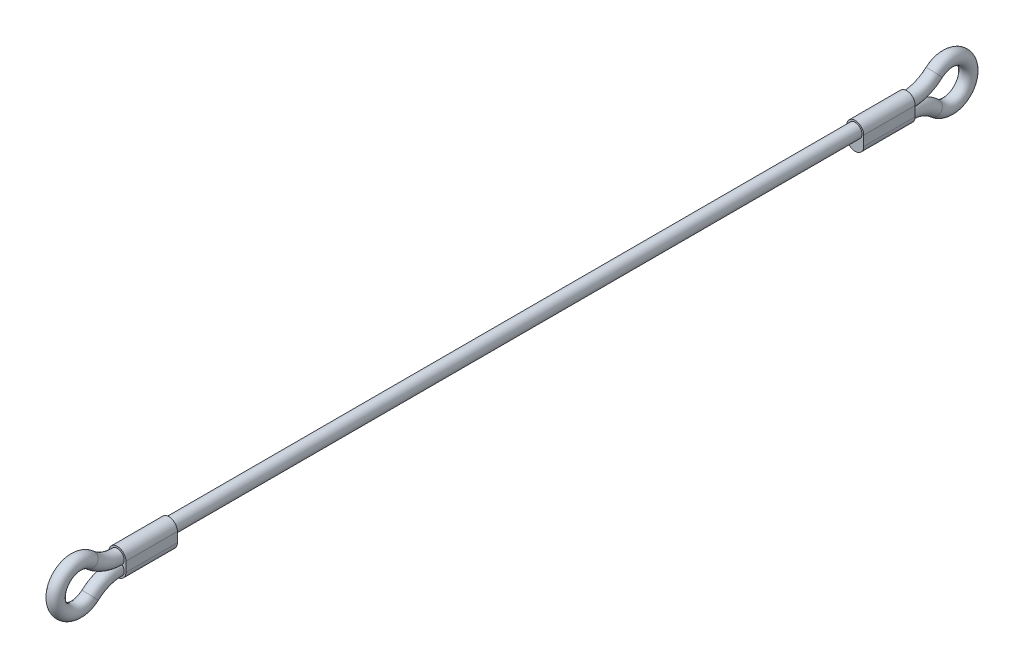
ISO-10303-21;
HEADER;
FILE_DESCRIPTION(('STEP AP214'),'2;1');
FILE_NAME('part.step','',(''),(''),'','','');
FILE_SCHEMA(('AUTOMOTIVE_DESIGN { 1 0 10303 214 1 1 1 1 }'));
ENDSEC;
DATA;
#1=APPLICATION_CONTEXT('core data for automotive mechanical design processes');
#2=APPLICATION_PROTOCOL_DEFINITION('international standard','automotive_design',2000,#1);
#3=PRODUCT_CONTEXT('',#1,'mechanical');
#4=PRODUCT('Part','Part','',(#3));
#5=PRODUCT_RELATED_PRODUCT_CATEGORY('part','',(#4));
#6=PRODUCT_DEFINITION_FORMATION('','',#4);
#7=PRODUCT_DEFINITION_CONTEXT('part definition',#1,'design');
#8=PRODUCT_DEFINITION('design','',#6,#7);
#9=PRODUCT_DEFINITION_SHAPE('','',#8);
#10=(LENGTH_UNIT() NAMED_UNIT(*) SI_UNIT(.MILLI.,.METRE.));
#11=(NAMED_UNIT(*) PLANE_ANGLE_UNIT() SI_UNIT($,.RADIAN.));
#12=(NAMED_UNIT(*) SI_UNIT($,.STERADIAN.) SOLID_ANGLE_UNIT());
#13=UNCERTAINTY_MEASURE_WITH_UNIT(LENGTH_MEASURE(1.E-05),#10,'distance_accuracy_value','');
#14=(GEOMETRIC_REPRESENTATION_CONTEXT(3) GLOBAL_UNCERTAINTY_ASSIGNED_CONTEXT((#13)) GLOBAL_UNIT_ASSIGNED_CONTEXT((#10,
#11,#12)) REPRESENTATION_CONTEXT('',''));
#15=CARTESIAN_POINT('',(0.,0.,0.));
#16=DIRECTION('',(0.,0.,1.));
#17=DIRECTION('',(1.,0.,0.));
#18=AXIS2_PLACEMENT_3D('',#15,#16,#17);
#19=CARTESIAN_POINT('',(0.,0.,-92.));
#20=DIRECTION('',(0.,0.,1.));
#21=DIRECTION('',(1.,0.,0.));
#22=AXIS2_PLACEMENT_3D('',#19,#20,#21);
#23=CYLINDRICAL_SURFACE('',#22,1.59);
#24=CARTESIAN_POINT('',(0.,0.,-80.));
#25=DIRECTION('',(0.,0.,1.));
#26=DIRECTION('',(0.,-1.,0.));
#27=AXIS2_PLACEMENT_3D('',#24,#25,#26);
#28=CIRCLE('',#27,1.59);
#29=CARTESIAN_POINT('',(0.,-1.59,-80.));
#30=VERTEX_POINT('',#29);
#31=EDGE_CURVE('E11',#30,#30,#28,.F.);
#32=ORIENTED_EDGE('',*,*,#31,.F.);
#33=EDGE_LOOP('',(#32));
#34=FACE_BOUND('',#33,.T.);
#35=CARTESIAN_POINT('',(0.,0.,80.));
#36=DIRECTION('',(0.,0.,-1.));
#37=DIRECTION('',(0.,1.,0.));
#38=AXIS2_PLACEMENT_3D('',#35,#36,#37);
#39=CIRCLE('',#38,1.59);
#40=CARTESIAN_POINT('',(0.,1.59,80.));
#41=VERTEX_POINT('',#40);
#42=EDGE_CURVE('E51',#41,#41,#39,.F.);
#43=ORIENTED_EDGE('',*,*,#42,.F.);
#44=EDGE_LOOP('',(#43));
#45=FACE_BOUND('',#44,.T.);
#46=ADVANCED_FACE('F41',(#34,#45),#23,.T.);
#47=CARTESIAN_POINT('',(0.,0.,80.));
#48=DIRECTION('',(0.,0.,1.));
#49=DIRECTION('',(0.,-1.,0.));
#50=AXIS2_PLACEMENT_3D('',#47,#48,#49);
#51=CYLINDRICAL_SURFACE('',#50,1.995);
#52=CARTESIAN_POINT('',(0.,0.,92.));
#53=DIRECTION('',(0.,0.,-1.));
#54=DIRECTION('',(0.,1.,0.));
#55=AXIS2_PLACEMENT_3D('',#52,#53,#54);
#56=CIRCLE('',#55,1.995);
#57=CARTESIAN_POINT('',(-1.995,0.,92.));
#58=VERTEX_POINT('',#57);
#59=CARTESIAN_POINT('',(1.995,0.,92.));
#60=VERTEX_POINT('',#59);
#61=EDGE_CURVE('E134',#58,#60,#56,.T.);
#62=ORIENTED_EDGE('',*,*,#61,.T.);
#63=DIRECTION('',(0.,0.,1.));
#64=VECTOR('',#63,1.);
#65=CARTESIAN_POINT('',(1.995,0.,80.));
#66=LINE('',#65,#64);
#67=CARTESIAN_POINT('',(1.995,0.,80.));
#68=VERTEX_POINT('',#67);
#69=EDGE_CURVE('E216',#68,#60,#66,.T.);
#70=ORIENTED_EDGE('',*,*,#69,.F.);
#71=CARTESIAN_POINT('',(0.,0.,80.));
#72=DIRECTION('',(0.,0.,-1.));
#73=DIRECTION('',(0.,1.,0.));
#74=AXIS2_PLACEMENT_3D('',#71,#72,#73);
#75=CIRCLE('',#74,1.995);
#76=CARTESIAN_POINT('',(-1.995,0.,80.));
#77=VERTEX_POINT('',#76);
#78=EDGE_CURVE('E179',#77,#68,#75,.T.);
#79=ORIENTED_EDGE('',*,*,#78,.F.);
#80=DIRECTION('',(0.,0.,1.));
#81=VECTOR('',#80,1.);
#82=CARTESIAN_POINT('',(-1.995,0.,80.));
#83=LINE('',#82,#81);
#84=EDGE_CURVE('E193',#77,#58,#83,.T.);
#85=ORIENTED_EDGE('',*,*,#84,.T.);
#86=EDGE_LOOP('',(#62,#70,#79,#85));
#87=FACE_BOUND('',#86,.T.);
#88=ADVANCED_FACE('F278',(#87),#51,.T.);
#89=CARTESIAN_POINT('',(1.995,0.,80.));
#90=DIRECTION('',(-1.,0.,0.));
#91=DIRECTION('',(0.,0.,1.));
#92=AXIS2_PLACEMENT_3D('',#89,#90,#91);
#93=PLANE('',#92);
#94=DIRECTION('',(0.,-1.,0.));
#95=VECTOR('',#94,1.);
#96=CARTESIAN_POINT('',(1.995,0.,92.));
#97=LINE('',#96,#95);
#98=CARTESIAN_POINT('',(1.995,-2.26625258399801,92.));
#99=VERTEX_POINT('',#98);
#100=EDGE_CURVE('E197',#60,#99,#97,.T.);
#101=ORIENTED_EDGE('',*,*,#100,.T.);
#102=DIRECTION('',(0.,0.,1.));
#103=VECTOR('',#102,1.);
#104=CARTESIAN_POINT('',(1.995,-2.26625258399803,80.));
#105=LINE('',#104,#103);
#106=CARTESIAN_POINT('',(1.995,-2.26625258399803,80.));
#107=VERTEX_POINT('',#106);
#108=EDGE_CURVE('E212',#107,#99,#105,.T.);
#109=ORIENTED_EDGE('',*,*,#108,.F.);
#110=DIRECTION('',(0.,-1.,0.));
#111=VECTOR('',#110,1.);
#112=CARTESIAN_POINT('',(1.995,0.,80.));
#113=LINE('',#112,#111);
#114=EDGE_CURVE('E183',#68,#107,#113,.T.);
#115=ORIENTED_EDGE('',*,*,#114,.F.);
#116=ORIENTED_EDGE('',*,*,#69,.T.);
#117=EDGE_LOOP('',(#101,#109,#115,#116));
#118=FACE_BOUND('',#117,.T.);
#119=ADVANCED_FACE('F283',(#118),#93,.F.);
#120=CARTESIAN_POINT('',(0.,-2.26625258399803,80.));
#121=DIRECTION('',(0.,0.,1.));
#122=DIRECTION('',(0.,-1.,0.));
#123=AXIS2_PLACEMENT_3D('',#120,#121,#122);
#124=CYLINDRICAL_SURFACE('',#123,1.995);
#125=CARTESIAN_POINT('',(0.,-2.26625258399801,92.));
#126=DIRECTION('',(0.,0.,-1.));
#127=DIRECTION('',(0.,1.,0.));
#128=AXIS2_PLACEMENT_3D('',#125,#126,#127);
#129=CIRCLE('',#128,1.995);
#130=CARTESIAN_POINT('',(-1.995,-2.26625258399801,92.));
#131=VERTEX_POINT('',#130);
#132=EDGE_CURVE('E200',#99,#131,#129,.T.);
#133=ORIENTED_EDGE('',*,*,#132,.T.);
#134=DIRECTION('',(0.,0.,1.));
#135=VECTOR('',#134,1.);
#136=CARTESIAN_POINT('',(-1.995,-2.26625258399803,80.));
#137=LINE('',#136,#135);
#138=CARTESIAN_POINT('',(-1.995,-2.26625258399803,80.));
#139=VERTEX_POINT('',#138);
#140=EDGE_CURVE('E208',#139,#131,#137,.T.);
#141=ORIENTED_EDGE('',*,*,#140,.F.);
#142=CARTESIAN_POINT('',(0.,-2.26625258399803,80.));
#143=DIRECTION('',(0.,0.,-1.));
#144=DIRECTION('',(0.,1.,0.));
#145=AXIS2_PLACEMENT_3D('',#142,#143,#144);
#146=CIRCLE('',#145,1.995);
#147=EDGE_CURVE('E187',#107,#139,#146,.T.);
#148=ORIENTED_EDGE('',*,*,#147,.F.);
#149=ORIENTED_EDGE('',*,*,#108,.T.);
#150=EDGE_LOOP('',(#133,#141,#148,#149));
#151=FACE_BOUND('',#150,.T.);
#152=ADVANCED_FACE('F324',(#151),#124,.T.);
#153=CARTESIAN_POINT('',(-1.995,0.,80.));
#154=DIRECTION('',(1.,0.,0.));
#155=DIRECTION('',(0.,1.,0.));
#156=AXIS2_PLACEMENT_3D('',#153,#154,#155);
#157=PLANE('',#156);
#158=DIRECTION('',(0.,1.,0.));
#159=VECTOR('',#158,1.);
#160=CARTESIAN_POINT('',(-1.995,0.,92.));
#161=LINE('',#160,#159);
#162=EDGE_CURVE('E184',#131,#58,#161,.T.);
#163=ORIENTED_EDGE('',*,*,#162,.T.);
#164=ORIENTED_EDGE('',*,*,#84,.F.);
#165=DIRECTION('',(0.,1.,0.));
#166=VECTOR('',#165,1.);
#167=CARTESIAN_POINT('',(-1.995,0.,80.));
#168=LINE('',#167,#166);
#169=EDGE_CURVE('E190',#139,#77,#168,.T.);
#170=ORIENTED_EDGE('',*,*,#169,.F.);
#171=ORIENTED_EDGE('',*,*,#140,.T.);
#172=EDGE_LOOP('',(#163,#164,#170,#171));
#173=FACE_BOUND('',#172,.T.);
#174=ADVANCED_FACE('F320',(#173),#157,.F.);
#175=CARTESIAN_POINT('',(0.,0.,80.));
#176=DIRECTION('',(0.,0.,-1.));
#177=DIRECTION('',(0.,1.,0.));
#178=AXIS2_PLACEMENT_3D('',#175,#176,#177);
#179=PLANE('',#178);
#180=ORIENTED_EDGE('',*,*,#42,.T.);
#181=EDGE_LOOP('',(#180));
#182=FACE_BOUND('',#181,.T.);
#183=ORIENTED_EDGE('',*,*,#78,.T.);
#184=ORIENTED_EDGE('',*,*,#114,.T.);
#185=ORIENTED_EDGE('',*,*,#147,.T.);
#186=ORIENTED_EDGE('',*,*,#169,.T.);
#187=EDGE_LOOP('',(#183,#184,#185,#186));
#188=FACE_BOUND('',#187,.T.);
#189=ADVANCED_FACE('F272',(#182,#188),#179,.T.);
#190=CARTESIAN_POINT('',(0.,0.,92.));
#191=DIRECTION('',(0.,0.,-1.));
#192=DIRECTION('',(0.,1.,0.));
#193=AXIS2_PLACEMENT_3D('',#190,#191,#192);
#194=PLANE('',#193);
#195=CARTESIAN_POINT('',(0.,0.,92.));
#196=DIRECTION('',(0.,0.,1.));
#197=DIRECTION('',(1.,0.,0.));
#198=AXIS2_PLACEMENT_3D('',#195,#196,#197);
#199=CIRCLE('',#198,1.59);
#200=CARTESIAN_POINT('',(1.1154034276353,-1.13312629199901,92.));
#201=VERTEX_POINT('',#200);
#202=CARTESIAN_POINT('',(-1.11540342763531,-1.13312629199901,92.));
#203=VERTEX_POINT('',#202);
#204=EDGE_CURVE('E233',#201,#203,#199,.T.);
#205=ORIENTED_EDGE('',*,*,#204,.F.);
#206=CARTESIAN_POINT('',(0.,-2.26625258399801,92.));
#207=DIRECTION('',(0.,0.,-1.));
#208=DIRECTION('',(1.,0.,0.));
#209=AXIS2_PLACEMENT_3D('',#206,#207,#208);
#210=CIRCLE('',#209,1.59);
#211=EDGE_CURVE('E64',#201,#203,#210,.T.);
#212=ORIENTED_EDGE('',*,*,#211,.T.);
#213=EDGE_LOOP('',(#205,#212));
#214=FACE_BOUND('',#213,.T.);
#215=ORIENTED_EDGE('',*,*,#61,.F.);
#216=ORIENTED_EDGE('',*,*,#162,.F.);
#217=ORIENTED_EDGE('',*,*,#132,.F.);
#218=ORIENTED_EDGE('',*,*,#100,.F.);
#219=EDGE_LOOP('',(#215,#216,#217,#218));
#220=FACE_BOUND('',#219,.T.);
#221=ADVANCED_FACE('F266',(#214,#220),#194,.F.);
#222=CARTESIAN_POINT('',(0.,-1.133126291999,101.6));
#223=DIRECTION('',(1.,0.,0.));
#224=DIRECTION('',(0.,0.,-1.));
#225=AXIS2_PLACEMENT_3D('',#222,#223,#224);
#226=TOROIDAL_SURFACE('',#225,4.80000000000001,1.59);
#227=CARTESIAN_POINT('',(0.,2.44458247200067,98.4));
#228=DIRECTION('',(0.,0.666666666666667,0.74535599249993));
#229=DIRECTION('',(1.,0.,0.));
#230=AXIS2_PLACEMENT_3D('',#227,#228,#229);
#231=CIRCLE('',#230,1.59);
#232=CARTESIAN_POINT('',(0.,3.62969850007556,97.34));
#233=VERTEX_POINT('',#232);
#234=EDGE_CURVE('E235',#233,#233,#231,.T.);
#235=CARTESIAN_POINT('',(0.,-4.71083505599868,98.4));
#236=DIRECTION('',(0.,0.666666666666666,-0.74535599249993));
#237=DIRECTION('',(1.,0.,0.));
#238=AXIS2_PLACEMENT_3D('',#235,#236,#237);
#239=CIRCLE('',#238,1.59);
#240=CARTESIAN_POINT('',(0.,-5.89595108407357,97.34));
#241=VERTEX_POINT('',#240);
#242=EDGE_CURVE('E239',#241,#241,#239,.T.);
#243=CARTESIAN_POINT('',(0.,-1.133126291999,101.6));
#244=DIRECTION('',(1.,0.,0.));
#245=DIRECTION('',(0.,0.,-1.));
#246=AXIS2_PLACEMENT_3D('',#243,#244,#245);
#247=CIRCLE('',#246,6.39000000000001);
#248=EDGE_CURVE('',#233,#241,#247,.T.);
#249=ORIENTED_EDGE('',*,*,#234,.T.);
#250=ORIENTED_EDGE('',*,*,#242,.F.);
#251=ORIENTED_EDGE('',*,*,#248,.T.);
#252=ORIENTED_EDGE('',*,*,#248,.F.);
#253=EDGE_LOOP('',(#249,#251,#250,#252));
#254=FACE_BOUND('',#253,.T.);
#255=ADVANCED_FACE('F264',(#254),#226,.T.);
#256=CARTESIAN_POINT('',(0.,-11.866252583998,92.));
#257=DIRECTION('',(-1.,0.,0.));
#258=DIRECTION('',(0.,0.,1.));
#259=AXIS2_PLACEMENT_3D('',#256,#257,#258);
#260=TOROIDAL_SURFACE('',#259,9.59999999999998,1.59);
#261=CARTESIAN_POINT('',(-1.11540342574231,-1.13312629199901,91.9998));
#262=CARTESIAN_POINT('',(-1.11534851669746,-1.13312629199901,92.1277367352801));
#263=CARTESIAN_POINT('',(-1.11308141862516,-1.13312629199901,92.2556863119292));
#264=CARTESIAN_POINT('',(-1.10371453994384,-1.13312629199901,92.5115582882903));
#265=CARTESIAN_POINT('',(-1.09660901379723,-1.13312629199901,92.6394804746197));
#266=CARTESIAN_POINT('',(-1.07704253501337,-1.13312629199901,92.8964186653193));
#267=CARTESIAN_POINT('',(-1.06452051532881,-1.13312629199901,93.0254301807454));
#268=CARTESIAN_POINT('',(-1.03319430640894,-1.13312629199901,93.2826272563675));
#269=CARTESIAN_POINT('',(-1.01439338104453,-1.13312629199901,93.4108132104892));
#270=CARTESIAN_POINT('',(-0.966908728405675,-1.13312629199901,93.6780053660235));
#271=CARTESIAN_POINT('',(-0.937456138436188,-1.13312629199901,93.8168833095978));
#272=CARTESIAN_POINT('',(-0.883915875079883,-1.13312629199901,94.0226312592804));
#273=CARTESIAN_POINT('',(-0.864530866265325,-1.13312629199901,94.0907246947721));
#274=CARTESIAN_POINT('',(-0.821996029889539,-1.13312629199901,94.2257156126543));
#275=CARTESIAN_POINT('',(-0.798847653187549,-1.13312629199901,94.292613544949));
#276=CARTESIAN_POINT('',(-0.744519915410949,-1.13312629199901,94.4335421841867));
#277=CARTESIAN_POINT('',(-0.712679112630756,-1.13312629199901,94.5073218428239));
#278=CARTESIAN_POINT('',(-0.641279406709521,-1.13312629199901,94.6511461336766));
#279=CARTESIAN_POINT('',(-0.601727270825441,-1.133126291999,94.721193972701));
#280=CARTESIAN_POINT('',(-0.528948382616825,-1.13312629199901,94.8294356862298));
#281=CARTESIAN_POINT('',(-0.498892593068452,-1.13312629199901,94.8697411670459));
#282=CARTESIAN_POINT('',(-0.4337700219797,-1.13312629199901,94.9461405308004));
#283=CARTESIAN_POINT('',(-0.398710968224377,-1.13312629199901,94.9822407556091));
#284=CARTESIAN_POINT('',(-0.335060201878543,-1.13312629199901,95.0370580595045));
#285=CARTESIAN_POINT('',(-0.308066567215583,-1.13312629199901,95.0576127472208));
#286=CARTESIAN_POINT('',(-0.251279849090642,-1.13312629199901,95.0944335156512));
#287=CARTESIAN_POINT('',(-0.221491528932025,-1.13312629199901,95.1107067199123));
#288=CARTESIAN_POINT('',(-0.165682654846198,-1.13312629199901,95.1347979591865));
#289=CARTESIAN_POINT('',(-0.140117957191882,-1.13312629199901,95.1436602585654));
#290=CARTESIAN_POINT('',(-0.0878641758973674,-1.13312629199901,95.1569907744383));
#291=CARTESIAN_POINT('',(-0.0611762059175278,-1.13312629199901,95.1614632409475));
#292=CARTESIAN_POINT('',(-0.00731772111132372,-1.13312629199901,95.165572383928));
#293=CARTESIAN_POINT('',(0.0198542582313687,-1.13312629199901,95.1651903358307));
#294=CARTESIAN_POINT('',(0.073695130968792,-1.13312629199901,95.1595861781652));
#295=CARTESIAN_POINT('',(0.100363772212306,-1.13312629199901,95.1543617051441));
#296=CARTESIAN_POINT('',(0.151195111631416,-1.13312629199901,95.1399571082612));
#297=CARTESIAN_POINT('',(0.175416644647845,-1.13312629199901,95.1309793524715));
#298=CARTESIAN_POINT('',(0.222373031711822,-1.13312629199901,95.1097742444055));
#299=CARTESIAN_POINT('',(0.245107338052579,-1.13312629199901,95.0975457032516));
#300=CARTESIAN_POINT('',(0.304759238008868,-1.13312629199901,95.0607488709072));
#301=CARTESIAN_POINT('',(0.340101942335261,-1.13312629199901,95.0336356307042));
#302=CARTESIAN_POINT('',(0.40628124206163,-1.13312629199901,94.9743688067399));
#303=CARTESIAN_POINT('',(0.43710254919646,-1.13312629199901,94.9421988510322));
#304=CARTESIAN_POINT('',(0.492718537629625,-1.13312629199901,94.8770136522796));
#305=CARTESIAN_POINT('',(0.517788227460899,-1.13312629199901,94.8442290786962));
#306=CARTESIAN_POINT('',(0.565060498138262,-1.13312629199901,94.7766392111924));
#307=CARTESIAN_POINT('',(0.587260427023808,-1.13312629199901,94.7418320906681));
#308=CARTESIAN_POINT('',(0.650275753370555,-1.13312629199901,94.6351509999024));
#309=CARTESIAN_POINT('',(0.687428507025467,-1.13312629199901,94.5611160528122));
#310=CARTESIAN_POINT('',(0.745434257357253,-1.13312629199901,94.4302751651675));
#311=CARTESIAN_POINT('',(0.767985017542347,-1.13312629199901,94.3741824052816));
#312=CARTESIAN_POINT('',(0.809859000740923,-1.13312629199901,94.2607969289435));
#313=CARTESIAN_POINT('',(0.829181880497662,-1.13312629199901,94.2035040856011));
#314=CARTESIAN_POINT('',(0.883166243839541,-1.133126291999,94.030173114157));
#315=CARTESIAN_POINT('',(0.913763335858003,-1.13312629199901,93.9128746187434));
#316=CARTESIAN_POINT('',(0.967023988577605,-1.13312629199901,93.6759552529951));
#317=CARTESIAN_POINT('',(0.989647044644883,-1.13312629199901,93.5563256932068));
#318=CARTESIAN_POINT('',(1.02845868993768,-1.13312629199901,93.3160128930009));
#319=CARTESIAN_POINT('',(1.04464572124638,-1.13312629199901,93.1953294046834));
#320=CARTESIAN_POINT('',(1.068187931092,-1.13312629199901,92.9845366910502));
#321=CARTESIAN_POINT('',(1.07674400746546,-1.13312629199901,92.8945564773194));
#322=CARTESIAN_POINT('',(1.09119671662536,-1.13312629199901,92.714367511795));
#323=CARTESIAN_POINT('',(1.09709289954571,-1.13312629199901,92.6241587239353));
#324=CARTESIAN_POINT('',(1.10635885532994,-1.13312629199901,92.4449391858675));
#325=CARTESIAN_POINT('',(1.10976438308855,-1.13312629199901,92.3559302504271));
#326=CARTESIAN_POINT('',(1.11428069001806,-1.13312629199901,92.1778802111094));
#327=CARTESIAN_POINT('',(1.1153921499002,-1.13312629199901,92.088839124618));
#328=CARTESIAN_POINT('',(1.11540342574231,-1.13312629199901,91.9998));
#329=B_SPLINE_CURVE_WITH_KNOTS('',3,(#261,#262,#263,#264,#265,#266,#267,#268,#269,#270,#271,
#272,#273,#274,#275,#276,#277,#278,#279,#280,#281,#282,#283,#284,#285,#286,#287,#288,#289,#290,
#291,#292,#293,#294,#295,#296,#297,#298,#299,#300,#301,#302,#303,#304,#305,#306,#307,#308,#309,
#310,#311,#312,#313,#314,#315,#316,#317,#318,#319,#320,#321,#322,#323,#324,#325,#326,#327,#328),
.UNSPECIFIED.,.F.,.F.,(4,2,2,2,2,2,2,2,2,2,2,2,2,2,2,2,2,2,2,2,2,2,2,2,2,2,2,2,2,2,2,2,2,4),(0.,
0.383810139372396,0.768076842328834,1.15679365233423,1.54530871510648,1.97071269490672,
2.18302701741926,2.39525968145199,2.6360416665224,2.87661329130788,3.02716706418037,
3.17749076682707,3.27898827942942,3.38031583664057,3.46115731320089,3.54192044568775,
3.62299518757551,3.70410952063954,3.78132200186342,3.85856276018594,3.99142265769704,
4.12472192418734,4.24834991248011,4.37209134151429,4.61994843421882,4.80123584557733,
4.98254252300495,5.34577733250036,5.71083149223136,6.0759739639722,6.34709439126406,
6.6182606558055,6.88545336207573,7.15256677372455),.UNSPECIFIED.);
#330=EDGE_CURVE('E244',#203,#201,#329,.T.);
#331=ORIENTED_EDGE('',*,*,#330,.F.);
#332=ORIENTED_EDGE('',*,*,#211,.F.);
#333=EDGE_LOOP('',(#331,#332));
#334=FACE_BOUND('',#333,.T.);
#335=ORIENTED_EDGE('',*,*,#242,.T.);
#336=EDGE_LOOP('',(#335));
#337=FACE_BOUND('',#336,.T.);
#338=ADVANCED_FACE('F43',(#334,#337),#260,.T.);
#339=CARTESIAN_POINT('',(0.,9.59999999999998,92.));
#340=DIRECTION('',(-1.,0.,0.));
#341=DIRECTION('',(0.,0.,1.));
#342=AXIS2_PLACEMENT_3D('',#339,#340,#341);
#343=TOROIDAL_SURFACE('',#342,9.59999999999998,1.59);
#344=ORIENTED_EDGE('',*,*,#234,.F.);
#345=EDGE_LOOP('',(#344));
#346=FACE_BOUND('',#345,.T.);
#347=ORIENTED_EDGE('',*,*,#204,.T.);
#348=ORIENTED_EDGE('',*,*,#330,.T.);
#349=EDGE_LOOP('',(#347,#348));
#350=FACE_BOUND('',#349,.T.);
#351=ADVANCED_FACE('F259',(#346,#350),#343,.T.);
#352=CARTESIAN_POINT('',(0.,0.,-80.));
#353=DIRECTION('',(0.,0.,-1.));
#354=DIRECTION('',(0.,1.,0.));
#355=AXIS2_PLACEMENT_3D('',#352,#353,#354);
#356=CYLINDRICAL_SURFACE('',#355,1.995);
#357=CARTESIAN_POINT('',(0.,0.,-92.));
#358=DIRECTION('',(0.,0.,-1.));
#359=DIRECTION('',(0.,1.,0.));
#360=AXIS2_PLACEMENT_3D('',#357,#358,#359);
#361=CIRCLE('',#360,1.995);
#362=CARTESIAN_POINT('',(-1.995,0.,-92.));
#363=VERTEX_POINT('',#362);
#364=CARTESIAN_POINT('',(1.995,0.,-92.));
#365=VERTEX_POINT('',#364);
#366=EDGE_CURVE('E128',#363,#365,#361,.T.);
#367=ORIENTED_EDGE('',*,*,#366,.F.);
#368=DIRECTION('',(0.,0.,-1.));
#369=VECTOR('',#368,1.);
#370=CARTESIAN_POINT('',(-1.995,0.,-80.));
#371=LINE('',#370,#369);
#372=CARTESIAN_POINT('',(-1.995,0.,-80.));
#373=VERTEX_POINT('',#372);
#374=EDGE_CURVE('E122',#373,#363,#371,.T.);
#375=ORIENTED_EDGE('',*,*,#374,.F.);
#376=CARTESIAN_POINT('',(0.,0.,-80.));
#377=DIRECTION('',(0.,0.,-1.));
#378=DIRECTION('',(0.,1.,0.));
#379=AXIS2_PLACEMENT_3D('',#376,#377,#378);
#380=CIRCLE('',#379,1.995);
#381=CARTESIAN_POINT('',(1.995,0.,-80.));
#382=VERTEX_POINT('',#381);
#383=EDGE_CURVE('E125',#373,#382,#380,.T.);
#384=ORIENTED_EDGE('',*,*,#383,.T.);
#385=DIRECTION('',(0.,0.,-1.));
#386=VECTOR('',#385,1.);
#387=CARTESIAN_POINT('',(1.995,0.,-80.));
#388=LINE('',#387,#386);
#389=EDGE_CURVE('E159',#382,#365,#388,.T.);
#390=ORIENTED_EDGE('',*,*,#389,.T.);
#391=EDGE_LOOP('',(#367,#375,#384,#390));
#392=FACE_BOUND('',#391,.T.);
#393=ADVANCED_FACE('F124',(#392),#356,.T.);
#394=CARTESIAN_POINT('',(-1.995,0.,-80.));
#395=DIRECTION('',(-1.,0.,0.));
#396=DIRECTION('',(0.,-1.,0.));
#397=AXIS2_PLACEMENT_3D('',#394,#395,#396);
#398=PLANE('',#397);
#399=DIRECTION('',(0.,1.,0.));
#400=VECTOR('',#399,1.);
#401=CARTESIAN_POINT('',(-1.995,0.,-92.));
#402=LINE('',#401,#400);
#403=CARTESIAN_POINT('',(-1.995,-2.26625258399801,-92.));
#404=VERTEX_POINT('',#403);
#405=EDGE_CURVE('E162',#404,#363,#402,.T.);
#406=ORIENTED_EDGE('',*,*,#405,.F.);
#407=DIRECTION('',(0.,0.,-1.));
#408=VECTOR('',#407,1.);
#409=CARTESIAN_POINT('',(-1.995,-2.26625258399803,-80.));
#410=LINE('',#409,#408);
#411=CARTESIAN_POINT('',(-1.995,-2.26625258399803,-80.));
#412=VERTEX_POINT('',#411);
#413=EDGE_CURVE('E135',#412,#404,#410,.T.);
#414=ORIENTED_EDGE('',*,*,#413,.F.);
#415=DIRECTION('',(0.,1.,0.));
#416=VECTOR('',#415,1.);
#417=CARTESIAN_POINT('',(-1.995,0.,-80.));
#418=LINE('',#417,#416);
#419=EDGE_CURVE('E141',#412,#373,#418,.T.);
#420=ORIENTED_EDGE('',*,*,#419,.T.);
#421=ORIENTED_EDGE('',*,*,#374,.T.);
#422=EDGE_LOOP('',(#406,#414,#420,#421));
#423=FACE_BOUND('',#422,.T.);
#424=ADVANCED_FACE('F148',(#423),#398,.T.);
#425=CARTESIAN_POINT('',(0.,-2.26625258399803,-80.));
#426=DIRECTION('',(0.,0.,-1.));
#427=DIRECTION('',(0.,1.,0.));
#428=AXIS2_PLACEMENT_3D('',#425,#426,#427);
#429=CYLINDRICAL_SURFACE('',#428,1.995);
#430=CARTESIAN_POINT('',(0.,-2.26625258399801,-92.));
#431=DIRECTION('',(0.,0.,-1.));
#432=DIRECTION('',(0.,1.,0.));
#433=AXIS2_PLACEMENT_3D('',#430,#431,#432);
#434=CIRCLE('',#433,1.995);
#435=CARTESIAN_POINT('',(1.995,-2.26625258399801,-92.));
#436=VERTEX_POINT('',#435);
#437=EDGE_CURVE('E165',#436,#404,#434,.T.);
#438=ORIENTED_EDGE('',*,*,#437,.F.);
#439=DIRECTION('',(0.,0.,-1.));
#440=VECTOR('',#439,1.);
#441=CARTESIAN_POINT('',(1.995,-2.26625258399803,-80.));
#442=LINE('',#441,#440);
#443=CARTESIAN_POINT('',(1.995,-2.26625258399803,-80.));
#444=VERTEX_POINT('',#443);
#445=EDGE_CURVE('E174',#444,#436,#442,.T.);
#446=ORIENTED_EDGE('',*,*,#445,.F.);
#447=CARTESIAN_POINT('',(0.,-2.26625258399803,-80.));
#448=DIRECTION('',(0.,0.,-1.));
#449=DIRECTION('',(0.,1.,0.));
#450=AXIS2_PLACEMENT_3D('',#447,#448,#449);
#451=CIRCLE('',#450,1.995);
#452=EDGE_CURVE('E150',#444,#412,#451,.T.);
#453=ORIENTED_EDGE('',*,*,#452,.T.);
#454=ORIENTED_EDGE('',*,*,#413,.T.);
#455=EDGE_LOOP('',(#438,#446,#453,#454));
#456=FACE_BOUND('',#455,.T.);
#457=ADVANCED_FACE('F307',(#456),#429,.T.);
#458=CARTESIAN_POINT('',(1.995,0.,-80.));
#459=DIRECTION('',(1.,0.,0.));
#460=DIRECTION('',(0.,0.,-1.));
#461=AXIS2_PLACEMENT_3D('',#458,#459,#460);
#462=PLANE('',#461);
#463=DIRECTION('',(0.,-1.,0.));
#464=VECTOR('',#463,1.);
#465=CARTESIAN_POINT('',(1.995,0.,-92.));
#466=LINE('',#465,#464);
#467=EDGE_CURVE('E146',#365,#436,#466,.T.);
#468=ORIENTED_EDGE('',*,*,#467,.F.);
#469=ORIENTED_EDGE('',*,*,#389,.F.);
#470=DIRECTION('',(0.,-1.,0.));
#471=VECTOR('',#470,1.);
#472=CARTESIAN_POINT('',(1.995,0.,-80.));
#473=LINE('',#472,#471);
#474=EDGE_CURVE('E144',#382,#444,#473,.T.);
#475=ORIENTED_EDGE('',*,*,#474,.T.);
#476=ORIENTED_EDGE('',*,*,#445,.T.);
#477=EDGE_LOOP('',(#468,#469,#475,#476));
#478=FACE_BOUND('',#477,.T.);
#479=ADVANCED_FACE('F304',(#478),#462,.T.);
#480=CARTESIAN_POINT('',(0.,0.,-80.));
#481=DIRECTION('',(0.,0.,1.));
#482=DIRECTION('',(0.,1.,0.));
#483=AXIS2_PLACEMENT_3D('',#480,#481,#482);
#484=PLANE('',#483);
#485=ORIENTED_EDGE('',*,*,#31,.T.);
#486=EDGE_LOOP('',(#485));
#487=FACE_BOUND('',#486,.T.);
#488=ORIENTED_EDGE('',*,*,#383,.F.);
#489=ORIENTED_EDGE('',*,*,#419,.F.);
#490=ORIENTED_EDGE('',*,*,#452,.F.);
#491=ORIENTED_EDGE('',*,*,#474,.F.);
#492=EDGE_LOOP('',(#488,#489,#490,#491));
#493=FACE_BOUND('',#492,.T.);
#494=ADVANCED_FACE('F139',(#487,#493),#484,.T.);
#495=CARTESIAN_POINT('',(0.,0.,-92.));
#496=DIRECTION('',(0.,0.,1.));
#497=DIRECTION('',(0.,1.,0.));
#498=AXIS2_PLACEMENT_3D('',#495,#496,#497);
#499=PLANE('',#498);
#500=CARTESIAN_POINT('',(0.,-2.26625258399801,-92.));
#501=DIRECTION('',(0.,0.,-1.));
#502=DIRECTION('',(1.,0.,0.));
#503=AXIS2_PLACEMENT_3D('',#500,#501,#502);
#504=CIRCLE('',#503,1.59);
#505=CARTESIAN_POINT('',(1.1154034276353,-1.133126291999,-92.));
#506=VERTEX_POINT('',#505);
#507=CARTESIAN_POINT('',(-1.11540342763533,-1.13312629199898,-92.));
#508=VERTEX_POINT('',#507);
#509=EDGE_CURVE('E220',#506,#508,#504,.T.);
#510=ORIENTED_EDGE('',*,*,#509,.F.);
#511=CARTESIAN_POINT('',(0.,0.,-92.));
#512=DIRECTION('',(0.,0.,1.));
#513=DIRECTION('',(1.,0.,0.));
#514=AXIS2_PLACEMENT_3D('',#511,#512,#513);
#515=CIRCLE('',#514,1.59);
#516=EDGE_CURVE('E57',#506,#508,#515,.T.);
#517=ORIENTED_EDGE('',*,*,#516,.T.);
#518=EDGE_LOOP('',(#510,#517));
#519=FACE_BOUND('',#518,.T.);
#520=ORIENTED_EDGE('',*,*,#366,.T.);
#521=ORIENTED_EDGE('',*,*,#467,.T.);
#522=ORIENTED_EDGE('',*,*,#437,.T.);
#523=ORIENTED_EDGE('',*,*,#405,.T.);
#524=EDGE_LOOP('',(#520,#521,#522,#523));
#525=FACE_BOUND('',#524,.T.);
#526=ADVANCED_FACE('F297',(#519,#525),#499,.F.);
#527=CARTESIAN_POINT('',(0.,-1.133126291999,-101.6));
#528=DIRECTION('',(1.,0.,0.));
#529=DIRECTION('',(0.,0.,-1.));
#530=AXIS2_PLACEMENT_3D('',#527,#528,#529);
#531=TOROIDAL_SURFACE('',#530,4.80000000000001,1.59);
#532=CARTESIAN_POINT('',(0.,-4.71083505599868,-98.4));
#533=DIRECTION('',(0.,-0.666666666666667,-0.74535599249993));
#534=DIRECTION('',(1.,0.,0.));
#535=AXIS2_PLACEMENT_3D('',#532,#533,#534);
#536=CIRCLE('',#535,1.59);
#537=CARTESIAN_POINT('',(0.,-5.89595108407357,-97.34));
#538=VERTEX_POINT('',#537);
#539=EDGE_CURVE('E223',#538,#538,#536,.T.);
#540=CARTESIAN_POINT('',(0.,2.44458247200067,-98.4));
#541=DIRECTION('',(0.,-0.666666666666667,0.74535599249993));
#542=DIRECTION('',(1.,0.,0.));
#543=AXIS2_PLACEMENT_3D('',#540,#541,#542);
#544=CIRCLE('',#543,1.59);
#545=CARTESIAN_POINT('',(0.,3.62969850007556,-97.34));
#546=VERTEX_POINT('',#545);
#547=EDGE_CURVE('E227',#546,#546,#544,.T.);
#548=CARTESIAN_POINT('',(0.,-1.133126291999,-101.6));
#549=DIRECTION('',(1.,0.,0.));
#550=DIRECTION('',(0.,0.,-1.));
#551=AXIS2_PLACEMENT_3D('',#548,#549,#550);
#552=CIRCLE('',#551,6.39000000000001);
#553=EDGE_CURVE('',#538,#546,#552,.T.);
#554=ORIENTED_EDGE('',*,*,#539,.T.);
#555=ORIENTED_EDGE('',*,*,#547,.F.);
#556=ORIENTED_EDGE('',*,*,#553,.T.);
#557=ORIENTED_EDGE('',*,*,#553,.F.);
#558=EDGE_LOOP('',(#554,#556,#555,#557));
#559=FACE_BOUND('',#558,.T.);
#560=ADVANCED_FACE('F300',(#559),#531,.T.);
#561=CARTESIAN_POINT('',(0.,9.59999999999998,-92.));
#562=DIRECTION('',(-1.,0.,0.));
#563=DIRECTION('',(0.,0.,1.));
#564=AXIS2_PLACEMENT_3D('',#561,#562,#563);
#565=TOROIDAL_SURFACE('',#564,9.59999999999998,1.59);
#566=CARTESIAN_POINT('',(-1.11540342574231,-1.133126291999,-91.9998));
#567=CARTESIAN_POINT('',(-1.11534851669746,-1.13312629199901,-92.1277367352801));
#568=CARTESIAN_POINT('',(-1.11308141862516,-1.13312629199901,-92.2556863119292));
#569=CARTESIAN_POINT('',(-1.10371453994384,-1.13312629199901,-92.5115582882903));
#570=CARTESIAN_POINT('',(-1.09660901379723,-1.13312629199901,-92.6394804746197));
#571=CARTESIAN_POINT('',(-1.07704253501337,-1.133126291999,-92.8964186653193));
#572=CARTESIAN_POINT('',(-1.06452051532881,-1.133126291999,-93.0254301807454));
#573=CARTESIAN_POINT('',(-1.03319430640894,-1.133126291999,-93.2826272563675));
#574=CARTESIAN_POINT('',(-1.01439338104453,-1.133126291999,-93.4108132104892));
#575=CARTESIAN_POINT('',(-0.966908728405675,-1.133126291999,-93.6780053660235));
#576=CARTESIAN_POINT('',(-0.937456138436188,-1.133126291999,-93.8168833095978));
#577=CARTESIAN_POINT('',(-0.883915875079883,-1.13312629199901,-94.0226312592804));
#578=CARTESIAN_POINT('',(-0.864530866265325,-1.13312629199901,-94.0907246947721));
#579=CARTESIAN_POINT('',(-0.821996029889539,-1.13312629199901,-94.2257156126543));
#580=CARTESIAN_POINT('',(-0.798847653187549,-1.13312629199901,-94.292613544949));
#581=CARTESIAN_POINT('',(-0.744519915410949,-1.133126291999,-94.4335421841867));
#582=CARTESIAN_POINT('',(-0.712679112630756,-1.133126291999,-94.5073218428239));
#583=CARTESIAN_POINT('',(-0.641279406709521,-1.13312629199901,-94.6511461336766));
#584=CARTESIAN_POINT('',(-0.601727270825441,-1.13312629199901,-94.721193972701));
#585=CARTESIAN_POINT('',(-0.528948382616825,-1.13312629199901,-94.8294356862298));
#586=CARTESIAN_POINT('',(-0.498892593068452,-1.13312629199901,-94.8697411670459));
#587=CARTESIAN_POINT('',(-0.4337700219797,-1.133126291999,-94.9461405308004));
#588=CARTESIAN_POINT('',(-0.398710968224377,-1.133126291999,-94.9822407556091));
#589=CARTESIAN_POINT('',(-0.335060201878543,-1.13312629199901,-95.0370580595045));
#590=CARTESIAN_POINT('',(-0.308066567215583,-1.13312629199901,-95.0576127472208));
#591=CARTESIAN_POINT('',(-0.251279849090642,-1.13312629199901,-95.0944335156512));
#592=CARTESIAN_POINT('',(-0.221491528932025,-1.133126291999,-95.1107067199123));
#593=CARTESIAN_POINT('',(-0.165682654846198,-1.133126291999,-95.1347979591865));
#594=CARTESIAN_POINT('',(-0.140117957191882,-1.133126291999,-95.1436602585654));
#595=CARTESIAN_POINT('',(-0.0878641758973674,-1.133126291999,-95.1569907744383));
#596=CARTESIAN_POINT('',(-0.0611762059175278,-1.133126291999,-95.1614632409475));
#597=CARTESIAN_POINT('',(-0.00731772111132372,-1.133126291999,-95.165572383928));
#598=CARTESIAN_POINT('',(0.0198542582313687,-1.133126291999,-95.1651903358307));
#599=CARTESIAN_POINT('',(0.073695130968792,-1.133126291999,-95.1595861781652));
#600=CARTESIAN_POINT('',(0.100363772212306,-1.133126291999,-95.1543617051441));
#601=CARTESIAN_POINT('',(0.151195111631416,-1.133126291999,-95.1399571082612));
#602=CARTESIAN_POINT('',(0.175416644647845,-1.133126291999,-95.1309793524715));
#603=CARTESIAN_POINT('',(0.222373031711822,-1.133126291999,-95.1097742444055));
#604=CARTESIAN_POINT('',(0.245107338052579,-1.133126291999,-95.0975457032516));
#605=CARTESIAN_POINT('',(0.304759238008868,-1.133126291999,-95.0607488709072));
#606=CARTESIAN_POINT('',(0.340101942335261,-1.133126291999,-95.0336356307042));
#607=CARTESIAN_POINT('',(0.40628124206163,-1.133126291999,-94.9743688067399));
#608=CARTESIAN_POINT('',(0.43710254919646,-1.13312629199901,-94.9421988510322));
#609=CARTESIAN_POINT('',(0.492718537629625,-1.133126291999,-94.8770136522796));
#610=CARTESIAN_POINT('',(0.517788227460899,-1.133126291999,-94.8442290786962));
#611=CARTESIAN_POINT('',(0.565060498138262,-1.133126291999,-94.7766392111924));
#612=CARTESIAN_POINT('',(0.587260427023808,-1.133126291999,-94.7418320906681));
#613=CARTESIAN_POINT('',(0.650275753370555,-1.13312629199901,-94.6351509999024));
#614=CARTESIAN_POINT('',(0.687428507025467,-1.133126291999,-94.5611160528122));
#615=CARTESIAN_POINT('',(0.745434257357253,-1.133126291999,-94.4302751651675));
#616=CARTESIAN_POINT('',(0.767985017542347,-1.13312629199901,-94.3741824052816));
#617=CARTESIAN_POINT('',(0.809859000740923,-1.13312629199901,-94.2607969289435));
#618=CARTESIAN_POINT('',(0.829181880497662,-1.13312629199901,-94.2035040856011));
#619=CARTESIAN_POINT('',(0.883166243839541,-1.13312629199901,-94.030173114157));
#620=CARTESIAN_POINT('',(0.913763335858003,-1.13312629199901,-93.9128746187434));
#621=CARTESIAN_POINT('',(0.967023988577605,-1.13312629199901,-93.6759552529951));
#622=CARTESIAN_POINT('',(0.989647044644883,-1.13312629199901,-93.5563256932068));
#623=CARTESIAN_POINT('',(1.02845868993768,-1.133126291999,-93.3160128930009));
#624=CARTESIAN_POINT('',(1.04464572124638,-1.133126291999,-93.1953294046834));
#625=CARTESIAN_POINT('',(1.068187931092,-1.133126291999,-92.9845366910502));
#626=CARTESIAN_POINT('',(1.07674400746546,-1.133126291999,-92.8945564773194));
#627=CARTESIAN_POINT('',(1.09119671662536,-1.133126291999,-92.714367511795));
#628=CARTESIAN_POINT('',(1.09709289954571,-1.133126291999,-92.6241587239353));
#629=CARTESIAN_POINT('',(1.10635885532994,-1.133126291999,-92.4449391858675));
#630=CARTESIAN_POINT('',(1.10976438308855,-1.133126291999,-92.3559302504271));
#631=CARTESIAN_POINT('',(1.11428069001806,-1.133126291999,-92.1778802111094));
#632=CARTESIAN_POINT('',(1.1153921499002,-1.133126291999,-92.088839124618));
#633=CARTESIAN_POINT('',(1.11540342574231,-1.133126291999,-91.9998));
#634=B_SPLINE_CURVE_WITH_KNOTS('',3,(#566,#567,#568,#569,#570,#571,#572,#573,#574,#575,#576,
#577,#578,#579,#580,#581,#582,#583,#584,#585,#586,#587,#588,#589,#590,#591,#592,#593,#594,#595,
#596,#597,#598,#599,#600,#601,#602,#603,#604,#605,#606,#607,#608,#609,#610,#611,#612,#613,#614,
#615,#616,#617,#618,#619,#620,#621,#622,#623,#624,#625,#626,#627,#628,#629,#630,#631,#632,#633),
.UNSPECIFIED.,.F.,.F.,(4,2,2,2,2,2,2,2,2,2,2,2,2,2,2,2,2,2,2,2,2,2,2,2,2,2,2,2,2,2,2,2,2,4),(0.,
0.383810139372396,0.768076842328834,1.15679365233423,1.54530871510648,1.97071269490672,
2.18302701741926,2.39525968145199,2.6360416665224,2.87661329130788,3.02716706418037,
3.17749076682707,3.27898827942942,3.38031583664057,3.46115731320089,3.54192044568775,
3.62299518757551,3.70410952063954,3.78132200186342,3.85856276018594,3.99142265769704,
4.12472192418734,4.24834991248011,4.37209134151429,4.61994843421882,4.80123584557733,
4.98254252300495,5.34577733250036,5.71083149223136,6.0759739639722,6.34709439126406,
6.6182606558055,6.88545336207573,7.15256677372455),.UNSPECIFIED.);
#635=EDGE_CURVE('E252',#508,#506,#634,.T.);
#636=ORIENTED_EDGE('',*,*,#635,.F.);
#637=ORIENTED_EDGE('',*,*,#516,.F.);
#638=EDGE_LOOP('',(#636,#637));
#639=FACE_BOUND('',#638,.T.);
#640=ORIENTED_EDGE('',*,*,#547,.T.);
#641=EDGE_LOOP('',(#640));
#642=FACE_BOUND('',#641,.T.);
#643=ADVANCED_FACE('F334',(#639,#642),#565,.T.);
#644=CARTESIAN_POINT('',(0.,-11.866252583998,-92.));
#645=DIRECTION('',(-1.,0.,0.));
#646=DIRECTION('',(0.,0.,1.));
#647=AXIS2_PLACEMENT_3D('',#644,#645,#646);
#648=TOROIDAL_SURFACE('',#647,9.59999999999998,1.59);
#649=ORIENTED_EDGE('',*,*,#539,.F.);
#650=EDGE_LOOP('',(#649));
#651=FACE_BOUND('',#650,.T.);
#652=ORIENTED_EDGE('',*,*,#509,.T.);
#653=ORIENTED_EDGE('',*,*,#635,.T.);
#654=EDGE_LOOP('',(#652,#653));
#655=FACE_BOUND('',#654,.T.);
#656=ADVANCED_FACE('F295',(#651,#655),#648,.T.);
#657=CLOSED_SHELL('',(#46,#88,#119,#152,#174,#189,#221,#255,#338,#351,#393,#424,#457,#479,#494,
#526,#560,#643,#656));
#658=MANIFOLD_SOLID_BREP('B2',#657);
#659=ADVANCED_BREP_SHAPE_REPRESENTATION('',(#18,#658),#14);
#660=SHAPE_DEFINITION_REPRESENTATION(#9,#659);
ENDSEC;
END-ISO-10303-21;
